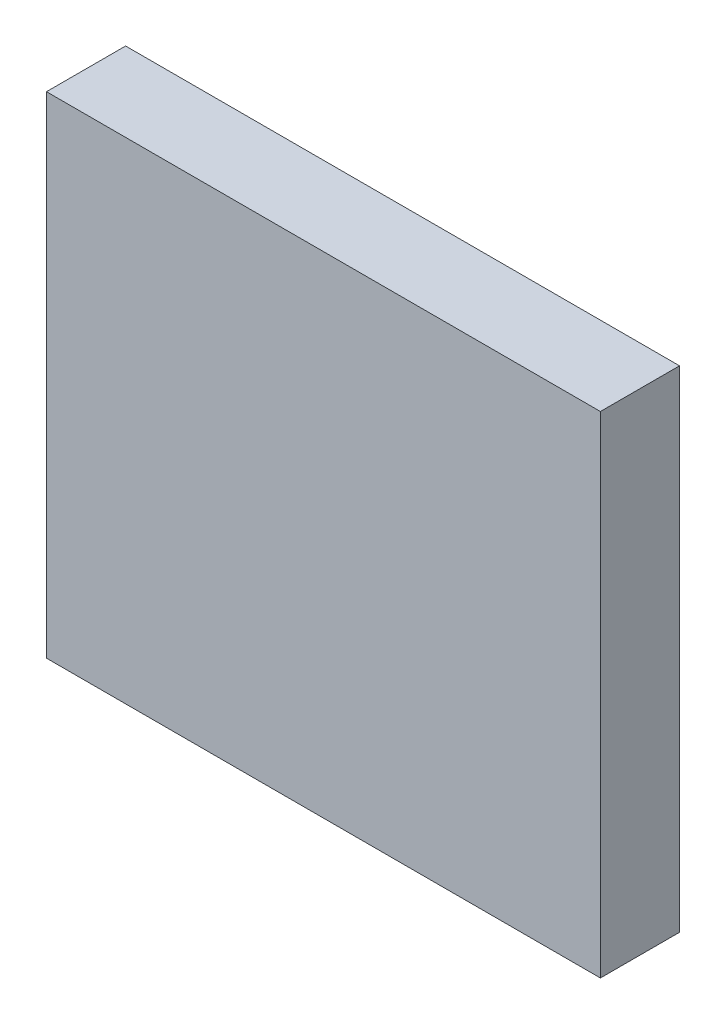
from build123d import *

# Parameters (mm, degrees)
SKIZZE1_W                       = 35
SKIZZE1_H                       = 31
AUFSATZ_LINEAR_AUSTRAGEN1_DEPTH = 5


with BuildPart() as part:
    # Skizze1 → Aufsatz-Linear austragen1 (new body)
    with BuildSketch(Plane.XY):
        with Locations((17.5, 15.5)):
            Rectangle(SKIZZE1_W, SKIZZE1_H)
    extrude(amount=AUFSATZ_LINEAR_AUSTRAGEN1_DEPTH)


solid = part.part
